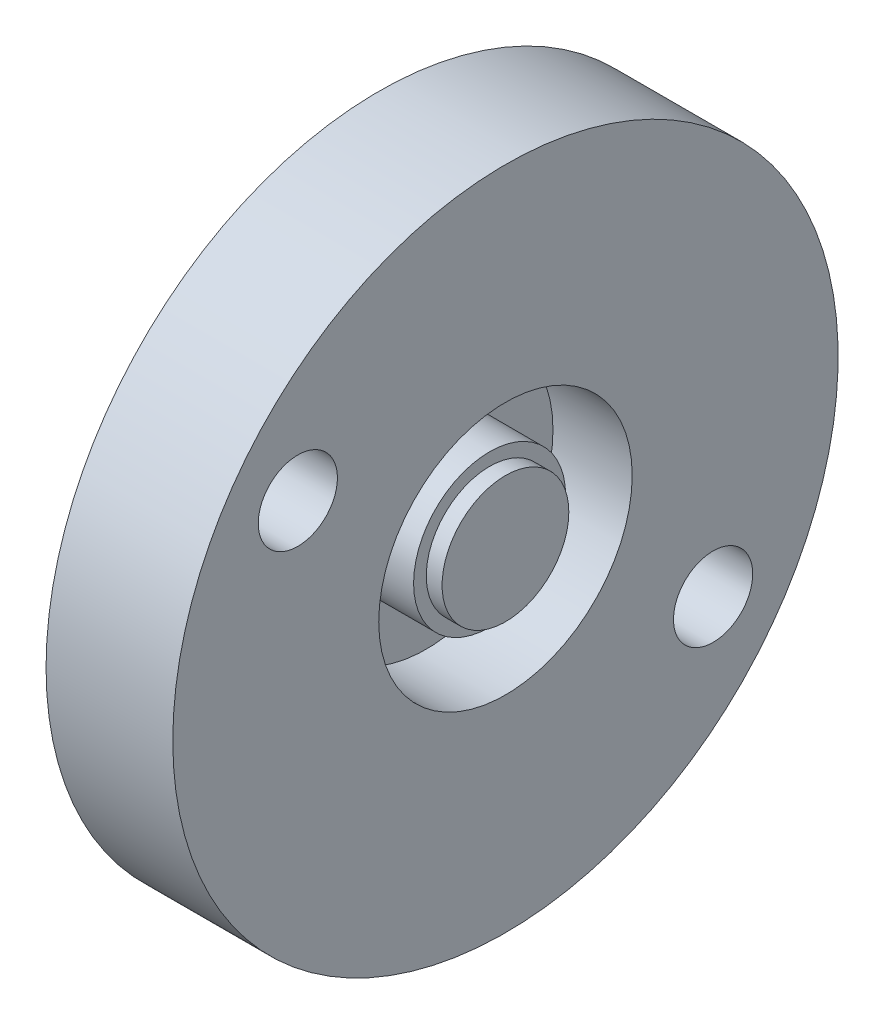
ISO-10303-21;
HEADER;
FILE_DESCRIPTION(('STEP AP214'),'2;1');
FILE_NAME('part.step','',(''),(''),'','','');
FILE_SCHEMA(('AUTOMOTIVE_DESIGN { 1 0 10303 214 1 1 1 1 }'));
ENDSEC;
DATA;
#1=APPLICATION_CONTEXT('core data for automotive mechanical design processes');
#2=APPLICATION_PROTOCOL_DEFINITION('international standard','automotive_design',2000,#1);
#3=PRODUCT_CONTEXT('',#1,'mechanical');
#4=PRODUCT('Part','Part','',(#3));
#5=PRODUCT_RELATED_PRODUCT_CATEGORY('part','',(#4));
#6=PRODUCT_DEFINITION_FORMATION('','',#4);
#7=PRODUCT_DEFINITION_CONTEXT('part definition',#1,'design');
#8=PRODUCT_DEFINITION('design','',#6,#7);
#9=PRODUCT_DEFINITION_SHAPE('','',#8);
#10=(LENGTH_UNIT() NAMED_UNIT(*) SI_UNIT(.MILLI.,.METRE.));
#11=(NAMED_UNIT(*) PLANE_ANGLE_UNIT() SI_UNIT($,.RADIAN.));
#12=(NAMED_UNIT(*) SI_UNIT($,.STERADIAN.) SOLID_ANGLE_UNIT());
#13=UNCERTAINTY_MEASURE_WITH_UNIT(LENGTH_MEASURE(1.E-05),#10,'distance_accuracy_value','');
#14=(GEOMETRIC_REPRESENTATION_CONTEXT(3) GLOBAL_UNCERTAINTY_ASSIGNED_CONTEXT((#13)) GLOBAL_UNIT_ASSIGNED_CONTEXT((#10,
#11,#12)) REPRESENTATION_CONTEXT('',''));
#15=CARTESIAN_POINT('',(0.,0.,0.));
#16=DIRECTION('',(0.,0.,1.));
#17=DIRECTION('',(1.,0.,0.));
#18=AXIS2_PLACEMENT_3D('',#15,#16,#17);
#19=CARTESIAN_POINT('',(1.905,0.,0.));
#20=DIRECTION('',(1.,0.,0.));
#21=DIRECTION('',(0.,0.,-1.));
#22=AXIS2_PLACEMENT_3D('',#19,#20,#21);
#23=PLANE('',#22);
#24=CARTESIAN_POINT('',(1.905,0.,0.));
#25=DIRECTION('',(1.,0.,0.));
#26=DIRECTION('',(0.,0.,-1.));
#27=AXIS2_PLACEMENT_3D('',#24,#25,#26);
#28=CIRCLE('',#27,3.048);
#29=CARTESIAN_POINT('',(1.905,0.,-3.048));
#30=VERTEX_POINT('',#29);
#31=EDGE_CURVE('E53',#30,#30,#28,.T.);
#32=ORIENTED_EDGE('',*,*,#31,.T.);
#33=EDGE_LOOP('',(#32));
#34=FACE_BOUND('',#33,.T.);
#35=CARTESIAN_POINT('',(1.905,0.,0.));
#36=DIRECTION('',(1.,0.,0.));
#37=DIRECTION('',(0.,0.,-1.));
#38=AXIS2_PLACEMENT_3D('',#35,#36,#37);
#39=CIRCLE('',#38,2.54);
#40=CARTESIAN_POINT('',(1.905,0.,-2.54));
#41=VERTEX_POINT('',#40);
#42=EDGE_CURVE('E57',#41,#41,#39,.T.);
#43=ORIENTED_EDGE('',*,*,#42,.F.);
#44=EDGE_LOOP('',(#43));
#45=FACE_BOUND('',#44,.T.);
#46=ADVANCED_FACE('F30',(#34,#45),#23,.T.);
#47=CARTESIAN_POINT('',(-0.634999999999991,0.,0.));
#48=DIRECTION('',(-1.,0.,0.));
#49=DIRECTION('',(0.,0.,1.));
#50=AXIS2_PLACEMENT_3D('',#47,#48,#49);
#51=PLANE('',#50);
#52=CARTESIAN_POINT('',(-0.634999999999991,0.,0.));
#53=DIRECTION('',(1.,0.,0.));
#54=DIRECTION('',(0.,0.,-1.));
#55=AXIS2_PLACEMENT_3D('',#52,#53,#54);
#56=CIRCLE('',#55,5.08000000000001);
#57=CARTESIAN_POINT('',(-0.634999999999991,0.,-5.08000000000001));
#58=VERTEX_POINT('',#57);
#59=EDGE_CURVE('E46',#58,#58,#56,.T.);
#60=ORIENTED_EDGE('',*,*,#59,.T.);
#61=EDGE_LOOP('',(#60));
#62=FACE_BOUND('',#61,.T.);
#63=CARTESIAN_POINT('',(-0.634999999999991,0.,0.));
#64=DIRECTION('',(-1.,0.,0.));
#65=DIRECTION('',(0.,0.,1.));
#66=AXIS2_PLACEMENT_3D('',#63,#64,#65);
#67=CIRCLE('',#66,3.048);
#68=CARTESIAN_POINT('',(-0.634999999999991,0.,3.048));
#69=VERTEX_POINT('',#68);
#70=EDGE_CURVE('E10',#69,#69,#67,.F.);
#71=ORIENTED_EDGE('',*,*,#70,.F.);
#72=EDGE_LOOP('',(#71));
#73=FACE_BOUND('',#72,.T.);
#74=ADVANCED_FACE('F89',(#62,#73),#51,.F.);
#75=CARTESIAN_POINT('',(-2.53999999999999,0.,0.));
#76=DIRECTION('',(1.,0.,0.));
#77=DIRECTION('',(0.,0.,-1.));
#78=AXIS2_PLACEMENT_3D('',#75,#76,#77);
#79=CYLINDRICAL_SURFACE('',#78,13.335);
#80=CARTESIAN_POINT('',(-2.53999999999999,0.,0.));
#81=DIRECTION('',(1.,0.,0.));
#82=DIRECTION('',(0.,0.,1.));
#83=AXIS2_PLACEMENT_3D('',#80,#81,#82);
#84=CIRCLE('',#83,13.335);
#85=CARTESIAN_POINT('',(-2.53999999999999,0.,13.335));
#86=VERTEX_POINT('',#85);
#87=EDGE_CURVE('E37',#86,#86,#84,.T.);
#88=ORIENTED_EDGE('',*,*,#87,.T.);
#89=EDGE_LOOP('',(#88));
#90=FACE_BOUND('',#89,.T.);
#91=CARTESIAN_POINT('',(2.53999999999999,0.,0.));
#92=DIRECTION('',(1.,0.,0.));
#93=DIRECTION('',(0.,0.,1.));
#94=AXIS2_PLACEMENT_3D('',#91,#92,#93);
#95=CIRCLE('',#94,13.335);
#96=CARTESIAN_POINT('',(2.53999999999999,0.,13.335));
#97=VERTEX_POINT('',#96);
#98=EDGE_CURVE('E41',#97,#97,#95,.T.);
#99=ORIENTED_EDGE('',*,*,#98,.F.);
#100=EDGE_LOOP('',(#99));
#101=FACE_BOUND('',#100,.T.);
#102=ADVANCED_FACE('F32',(#90,#101),#79,.T.);
#103=CARTESIAN_POINT('',(-2.53999999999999,0.,0.));
#104=DIRECTION('',(-1.,0.,0.));
#105=DIRECTION('',(0.,0.,1.));
#106=AXIS2_PLACEMENT_3D('',#103,#104,#105);
#107=PLANE('',#106);
#108=ORIENTED_EDGE('',*,*,#87,.F.);
#109=EDGE_LOOP('',(#108));
#110=FACE_BOUND('',#109,.T.);
#111=ADVANCED_FACE('F81',(#110),#107,.T.);
#112=CARTESIAN_POINT('',(2.53999999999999,0.,0.));
#113=DIRECTION('',(-1.,0.,0.));
#114=DIRECTION('',(0.,0.,1.));
#115=AXIS2_PLACEMENT_3D('',#112,#113,#114);
#116=PLANE('',#115);
#117=CARTESIAN_POINT('',(2.53999999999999,-5.82753659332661,-8.32258476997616));
#118=DIRECTION('',(1.,0.,0.));
#119=DIRECTION('',(0.,0.,-1.));
#120=AXIS2_PLACEMENT_3D('',#117,#118,#119);
#121=CIRCLE('',#120,1.58750000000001);
#122=CARTESIAN_POINT('',(2.53999999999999,-5.82753659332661,-9.91008476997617));
#123=VERTEX_POINT('',#122);
#124=EDGE_CURVE('E71',#123,#123,#121,.T.);
#125=ORIENTED_EDGE('',*,*,#124,.F.);
#126=EDGE_LOOP('',(#125));
#127=FACE_BOUND('',#126,.T.);
#128=CARTESIAN_POINT('',(2.53999999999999,5.82753659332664,8.32258476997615));
#129=DIRECTION('',(1.,0.,0.));
#130=DIRECTION('',(0.,0.,-1.));
#131=AXIS2_PLACEMENT_3D('',#128,#129,#130);
#132=CIRCLE('',#131,1.58750000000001);
#133=CARTESIAN_POINT('',(2.53999999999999,5.82753659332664,6.73508476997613));
#134=VERTEX_POINT('',#133);
#135=EDGE_CURVE('E65',#134,#134,#132,.T.);
#136=ORIENTED_EDGE('',*,*,#135,.F.);
#137=EDGE_LOOP('',(#136));
#138=FACE_BOUND('',#137,.T.);
#139=CARTESIAN_POINT('',(2.53999999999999,0.,0.));
#140=DIRECTION('',(1.,0.,0.));
#141=DIRECTION('',(0.,0.,-1.));
#142=AXIS2_PLACEMENT_3D('',#139,#140,#141);
#143=CIRCLE('',#142,5.08000000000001);
#144=CARTESIAN_POINT('',(2.53999999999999,0.,-5.08000000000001));
#145=VERTEX_POINT('',#144);
#146=EDGE_CURVE('E50',#145,#145,#143,.T.);
#147=ORIENTED_EDGE('',*,*,#146,.F.);
#148=EDGE_LOOP('',(#147));
#149=FACE_BOUND('',#148,.T.);
#150=ORIENTED_EDGE('',*,*,#98,.T.);
#151=EDGE_LOOP('',(#150));
#152=FACE_BOUND('',#151,.T.);
#153=ADVANCED_FACE('F77',(#127,#138,#149,#152),#116,.F.);
#154=CARTESIAN_POINT('',(2.53999999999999,0.,0.));
#155=DIRECTION('',(1.,0.,0.));
#156=DIRECTION('',(0.,0.,-1.));
#157=AXIS2_PLACEMENT_3D('',#154,#155,#156);
#158=CYLINDRICAL_SURFACE('',#157,5.08000000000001);
#159=ORIENTED_EDGE('',*,*,#59,.F.);
#160=EDGE_LOOP('',(#159));
#161=FACE_BOUND('',#160,.T.);
#162=ORIENTED_EDGE('',*,*,#146,.T.);
#163=EDGE_LOOP('',(#162));
#164=FACE_BOUND('',#163,.T.);
#165=ADVANCED_FACE('F80',(#161,#164),#158,.F.);
#166=CARTESIAN_POINT('',(1.905,0.,0.));
#167=DIRECTION('',(-1.,0.,0.));
#168=DIRECTION('',(0.,0.,1.));
#169=AXIS2_PLACEMENT_3D('',#166,#167,#168);
#170=CYLINDRICAL_SURFACE('',#169,3.048);
#171=ORIENTED_EDGE('',*,*,#31,.F.);
#172=EDGE_LOOP('',(#171));
#173=FACE_BOUND('',#172,.T.);
#174=ORIENTED_EDGE('',*,*,#70,.T.);
#175=EDGE_LOOP('',(#174));
#176=FACE_BOUND('',#175,.T.);
#177=ADVANCED_FACE('F108',(#173,#176),#170,.T.);
#178=CARTESIAN_POINT('',(2.53999999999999,0.,0.));
#179=DIRECTION('',(-1.,0.,0.));
#180=DIRECTION('',(0.,0.,1.));
#181=AXIS2_PLACEMENT_3D('',#178,#179,#180);
#182=CYLINDRICAL_SURFACE('',#181,2.54);
#183=CARTESIAN_POINT('',(2.53999999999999,0.,0.));
#184=DIRECTION('',(1.,0.,0.));
#185=DIRECTION('',(0.,0.,-1.));
#186=AXIS2_PLACEMENT_3D('',#183,#184,#185);
#187=CIRCLE('',#186,2.54);
#188=CARTESIAN_POINT('',(2.53999999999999,0.,-2.54));
#189=VERTEX_POINT('',#188);
#190=EDGE_CURVE('E56',#189,#189,#187,.T.);
#191=ORIENTED_EDGE('',*,*,#190,.F.);
#192=EDGE_LOOP('',(#191));
#193=FACE_BOUND('',#192,.T.);
#194=ORIENTED_EDGE('',*,*,#42,.T.);
#195=EDGE_LOOP('',(#194));
#196=FACE_BOUND('',#195,.T.);
#197=ADVANCED_FACE('F106',(#193,#196),#182,.T.);
#198=CARTESIAN_POINT('',(2.53999999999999,0.,0.));
#199=DIRECTION('',(1.,0.,0.));
#200=DIRECTION('',(0.,0.,-1.));
#201=AXIS2_PLACEMENT_3D('',#198,#199,#200);
#202=PLANE('',#201);
#203=ORIENTED_EDGE('',*,*,#190,.T.);
#204=EDGE_LOOP('',(#203));
#205=FACE_BOUND('',#204,.T.);
#206=ADVANCED_FACE('F133',(#205),#202,.T.);
#207=CARTESIAN_POINT('',(0.,5.82753659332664,8.32258476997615));
#208=DIRECTION('',(-1.,0.,0.));
#209=DIRECTION('',(0.,0.,1.));
#210=AXIS2_PLACEMENT_3D('',#207,#208,#209);
#211=PLANE('',#210);
#212=CARTESIAN_POINT('',(0.,5.82753659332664,8.32258476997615));
#213=DIRECTION('',(1.,0.,0.));
#214=DIRECTION('',(0.,0.,-1.));
#215=AXIS2_PLACEMENT_3D('',#212,#213,#214);
#216=CIRCLE('',#215,1.58750000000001);
#217=CARTESIAN_POINT('',(0.,5.82753659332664,6.73508476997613));
#218=VERTEX_POINT('',#217);
#219=EDGE_CURVE('E60',#218,#218,#216,.T.);
#220=ORIENTED_EDGE('',*,*,#219,.T.);
#221=EDGE_LOOP('',(#220));
#222=FACE_BOUND('',#221,.T.);
#223=ADVANCED_FACE('F140',(#222),#211,.F.);
#224=CARTESIAN_POINT('',(2.53999999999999,5.82753659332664,8.32258476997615));
#225=DIRECTION('',(1.,0.,0.));
#226=DIRECTION('',(0.,0.,-1.));
#227=AXIS2_PLACEMENT_3D('',#224,#225,#226);
#228=CYLINDRICAL_SURFACE('',#227,1.58750000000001);
#229=ORIENTED_EDGE('',*,*,#219,.F.);
#230=EDGE_LOOP('',(#229));
#231=FACE_BOUND('',#230,.T.);
#232=ORIENTED_EDGE('',*,*,#135,.T.);
#233=EDGE_LOOP('',(#232));
#234=FACE_BOUND('',#233,.T.);
#235=ADVANCED_FACE('F147',(#231,#234),#228,.F.);
#236=CARTESIAN_POINT('',(0.,-5.82753659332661,-8.32258476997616));
#237=DIRECTION('',(-1.,0.,0.));
#238=DIRECTION('',(0.,0.,1.));
#239=AXIS2_PLACEMENT_3D('',#236,#237,#238);
#240=PLANE('',#239);
#241=CARTESIAN_POINT('',(0.,-5.82753659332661,-8.32258476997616));
#242=DIRECTION('',(1.,0.,0.));
#243=DIRECTION('',(0.,0.,-1.));
#244=AXIS2_PLACEMENT_3D('',#241,#242,#243);
#245=CIRCLE('',#244,1.58750000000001);
#246=CARTESIAN_POINT('',(0.,-5.82753659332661,-9.91008476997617));
#247=VERTEX_POINT('',#246);
#248=EDGE_CURVE('E68',#247,#247,#245,.T.);
#249=ORIENTED_EDGE('',*,*,#248,.T.);
#250=EDGE_LOOP('',(#249));
#251=FACE_BOUND('',#250,.T.);
#252=ADVANCED_FACE('F155',(#251),#240,.F.);
#253=CARTESIAN_POINT('',(2.53999999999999,-5.82753659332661,-8.32258476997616));
#254=DIRECTION('',(1.,0.,0.));
#255=DIRECTION('',(0.,0.,-1.));
#256=AXIS2_PLACEMENT_3D('',#253,#254,#255);
#257=CYLINDRICAL_SURFACE('',#256,1.58750000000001);
#258=ORIENTED_EDGE('',*,*,#248,.F.);
#259=EDGE_LOOP('',(#258));
#260=FACE_BOUND('',#259,.T.);
#261=ORIENTED_EDGE('',*,*,#124,.T.);
#262=EDGE_LOOP('',(#261));
#263=FACE_BOUND('',#262,.T.);
#264=ADVANCED_FACE('F75',(#260,#263),#257,.F.);
#265=CLOSED_SHELL('',(#46,#74,#102,#111,#153,#165,#177,#197,#206,#223,#235,#252,#264));
#266=MANIFOLD_SOLID_BREP('B2',#265);
#267=ADVANCED_BREP_SHAPE_REPRESENTATION('',(#18,#266),#14);
#268=SHAPE_DEFINITION_REPRESENTATION(#9,#267);
ENDSEC;
END-ISO-10303-21;
